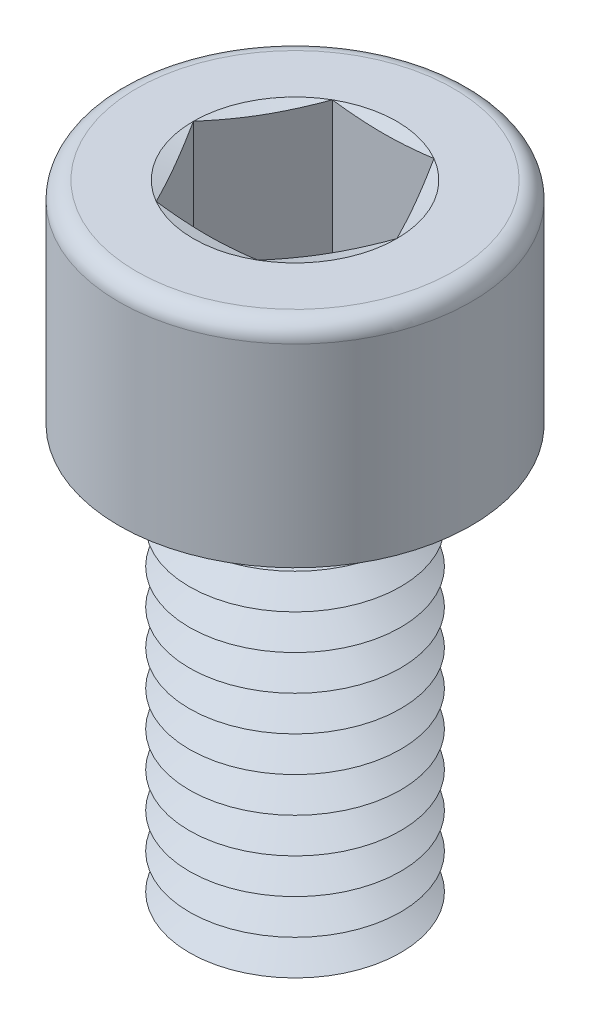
ISO-10303-21;
HEADER;
FILE_DESCRIPTION(('STEP AP214'),'2;1');
FILE_NAME('part.step','',(''),(''),'','','');
FILE_SCHEMA(('AUTOMOTIVE_DESIGN { 1 0 10303 214 1 1 1 1 }'));
ENDSEC;
DATA;
#1=APPLICATION_CONTEXT('core data for automotive mechanical design processes');
#2=APPLICATION_PROTOCOL_DEFINITION('international standard','automotive_design',2000,#1);
#3=PRODUCT_CONTEXT('',#1,'mechanical');
#4=PRODUCT('Part','Part','',(#3));
#5=PRODUCT_RELATED_PRODUCT_CATEGORY('part','',(#4));
#6=PRODUCT_DEFINITION_FORMATION('','',#4);
#7=PRODUCT_DEFINITION_CONTEXT('part definition',#1,'design');
#8=PRODUCT_DEFINITION('design','',#6,#7);
#9=PRODUCT_DEFINITION_SHAPE('','',#8);
#10=(LENGTH_UNIT() NAMED_UNIT(*) SI_UNIT(.MILLI.,.METRE.));
#11=(NAMED_UNIT(*) PLANE_ANGLE_UNIT() SI_UNIT($,.RADIAN.));
#12=(NAMED_UNIT(*) SI_UNIT($,.STERADIAN.) SOLID_ANGLE_UNIT());
#13=UNCERTAINTY_MEASURE_WITH_UNIT(LENGTH_MEASURE(1.E-05),#10,'distance_accuracy_value','');
#14=(GEOMETRIC_REPRESENTATION_CONTEXT(3) GLOBAL_UNCERTAINTY_ASSIGNED_CONTEXT((#13)) GLOBAL_UNIT_ASSIGNED_CONTEXT((#10,
#11,#12)) REPRESENTATION_CONTEXT('',''));
#15=CARTESIAN_POINT('',(0.,0.,0.));
#16=DIRECTION('',(0.,0.,1.));
#17=DIRECTION('',(1.,0.,0.));
#18=AXIS2_PLACEMENT_3D('',#15,#16,#17);
#19=CARTESIAN_POINT('',(0.,4.,0.));
#20=DIRECTION('',(0.,1.,0.));
#21=DIRECTION('',(0.,0.,1.));
#22=AXIS2_PLACEMENT_3D('',#19,#20,#21);
#23=CONICAL_SURFACE('',#22,2.13397459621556,1.0471975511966);
#24=CARTESIAN_POINT('',(0.,4.5,0.));
#25=DIRECTION('',(0.,1.,0.));
#26=DIRECTION('',(0.,0.,1.));
#27=AXIS2_PLACEMENT_3D('',#24,#25,#26);
#28=CIRCLE('',#27,3.);
#29=CARTESIAN_POINT('',(0.,4.5,3.));
#30=VERTEX_POINT('',#29);
#31=EDGE_CURVE('E407',#30,#30,#28,.T.);
#32=ORIENTED_EDGE('',*,*,#31,.F.);
#33=EDGE_LOOP('',(#32));
#34=FACE_BOUND('',#33,.T.);
#35=CARTESIAN_POINT('',(0.,4.,0.));
#36=DIRECTION('',(0.,1.,0.));
#37=DIRECTION('',(0.,0.,1.));
#38=AXIS2_PLACEMENT_3D('',#35,#36,#37);
#39=CIRCLE('',#38,2.13397459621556);
#40=CARTESIAN_POINT('',(0.,4.,2.13397459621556));
#41=VERTEX_POINT('',#40);
#42=EDGE_CURVE('E411',#41,#41,#39,.T.);
#43=ORIENTED_EDGE('',*,*,#42,.T.);
#44=EDGE_LOOP('',(#43));
#45=FACE_BOUND('',#44,.T.);
#46=ADVANCED_FACE('F41',(#34,#45),#23,.T.);
#47=CARTESIAN_POINT('',(0.,3.5,0.));
#48=DIRECTION('',(0.,-1.,0.));
#49=DIRECTION('',(0.,0.,-1.));
#50=AXIS2_PLACEMENT_3D('',#47,#48,#49);
#51=CONICAL_SURFACE('',#50,3.,1.0471975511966);
#52=ORIENTED_EDGE('',*,*,#42,.F.);
#53=EDGE_LOOP('',(#52));
#54=FACE_BOUND('',#53,.T.);
#55=CARTESIAN_POINT('',(0.,3.5,0.));
#56=DIRECTION('',(0.,1.,0.));
#57=DIRECTION('',(0.,0.,1.));
#58=AXIS2_PLACEMENT_3D('',#55,#56,#57);
#59=CIRCLE('',#58,3.);
#60=CARTESIAN_POINT('',(0.,3.5,3.));
#61=VERTEX_POINT('',#60);
#62=EDGE_CURVE('E415',#61,#61,#59,.T.);
#63=ORIENTED_EDGE('',*,*,#62,.T.);
#64=EDGE_LOOP('',(#63));
#65=FACE_BOUND('',#64,.T.);
#66=ADVANCED_FACE('F251',(#54,#65),#51,.T.);
#67=CARTESIAN_POINT('',(0.,0.,0.));
#68=DIRECTION('',(0.,1.,0.));
#69=DIRECTION('',(0.,0.,1.));
#70=AXIS2_PLACEMENT_3D('',#67,#68,#69);
#71=PLANE('',#70);
#72=CARTESIAN_POINT('',(0.,0.,0.));
#73=DIRECTION('',(0.,1.,0.));
#74=DIRECTION('',(0.,0.,1.));
#75=AXIS2_PLACEMENT_3D('',#72,#73,#74);
#76=CIRCLE('',#75,2.13397459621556);
#77=CARTESIAN_POINT('',(0.,0.,2.13397459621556));
#78=VERTEX_POINT('',#77);
#79=EDGE_CURVE('E442',#78,#78,#76,.T.);
#80=ORIENTED_EDGE('',*,*,#79,.F.);
#81=EDGE_LOOP('',(#80));
#82=FACE_BOUND('',#81,.T.);
#83=ADVANCED_FACE('F248',(#82),#71,.F.);
#84=CARTESIAN_POINT('',(0.,0.,0.));
#85=DIRECTION('',(0.,1.,0.));
#86=DIRECTION('',(0.,0.,1.));
#87=AXIS2_PLACEMENT_3D('',#84,#85,#86);
#88=CONICAL_SURFACE('',#87,2.13397459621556,1.0471975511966);
#89=CARTESIAN_POINT('',(0.,0.5,0.));
#90=DIRECTION('',(0.,1.,0.));
#91=DIRECTION('',(0.,0.,1.));
#92=AXIS2_PLACEMENT_3D('',#89,#90,#91);
#93=CIRCLE('',#92,3.);
#94=CARTESIAN_POINT('',(0.,0.5,3.));
#95=VERTEX_POINT('',#94);
#96=EDGE_CURVE('E438',#95,#95,#93,.T.);
#97=ORIENTED_EDGE('',*,*,#96,.F.);
#98=EDGE_LOOP('',(#97));
#99=FACE_BOUND('',#98,.T.);
#100=ORIENTED_EDGE('',*,*,#79,.T.);
#101=EDGE_LOOP('',(#100));
#102=FACE_BOUND('',#101,.T.);
#103=ADVANCED_FACE('F250',(#99,#102),#88,.T.);
#104=CARTESIAN_POINT('',(0.,0.5,0.));
#105=DIRECTION('',(0.,-1.,0.));
#106=DIRECTION('',(0.,0.,-1.));
#107=AXIS2_PLACEMENT_3D('',#104,#105,#106);
#108=CONICAL_SURFACE('',#107,3.,1.0471975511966);
#109=CARTESIAN_POINT('',(0.,1.,0.));
#110=DIRECTION('',(0.,1.,0.));
#111=DIRECTION('',(0.,0.,1.));
#112=AXIS2_PLACEMENT_3D('',#109,#110,#111);
#113=CIRCLE('',#112,2.13397459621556);
#114=CARTESIAN_POINT('',(0.,1.,2.13397459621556));
#115=VERTEX_POINT('',#114);
#116=EDGE_CURVE('E435',#115,#115,#113,.T.);
#117=ORIENTED_EDGE('',*,*,#116,.F.);
#118=EDGE_LOOP('',(#117));
#119=FACE_BOUND('',#118,.T.);
#120=ORIENTED_EDGE('',*,*,#96,.T.);
#121=EDGE_LOOP('',(#120));
#122=FACE_BOUND('',#121,.T.);
#123=ADVANCED_FACE('F291',(#119,#122),#108,.T.);
#124=CARTESIAN_POINT('',(0.,1.,0.));
#125=DIRECTION('',(0.,1.,0.));
#126=DIRECTION('',(0.,0.,1.));
#127=AXIS2_PLACEMENT_3D('',#124,#125,#126);
#128=CONICAL_SURFACE('',#127,2.13397459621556,1.0471975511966);
#129=CARTESIAN_POINT('',(0.,1.5,0.));
#130=DIRECTION('',(0.,1.,0.));
#131=DIRECTION('',(0.,0.,1.));
#132=AXIS2_PLACEMENT_3D('',#129,#130,#131);
#133=CIRCLE('',#132,3.);
#134=CARTESIAN_POINT('',(0.,1.5,3.));
#135=VERTEX_POINT('',#134);
#136=EDGE_CURVE('E431',#135,#135,#133,.T.);
#137=ORIENTED_EDGE('',*,*,#136,.F.);
#138=EDGE_LOOP('',(#137));
#139=FACE_BOUND('',#138,.T.);
#140=ORIENTED_EDGE('',*,*,#116,.T.);
#141=EDGE_LOOP('',(#140));
#142=FACE_BOUND('',#141,.T.);
#143=ADVANCED_FACE('F286',(#139,#142),#128,.T.);
#144=CARTESIAN_POINT('',(0.,1.5,0.));
#145=DIRECTION('',(0.,-1.,0.));
#146=DIRECTION('',(0.,0.,-1.));
#147=AXIS2_PLACEMENT_3D('',#144,#145,#146);
#148=CONICAL_SURFACE('',#147,3.,1.0471975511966);
#149=CARTESIAN_POINT('',(0.,2.,0.));
#150=DIRECTION('',(0.,1.,0.));
#151=DIRECTION('',(0.,0.,1.));
#152=AXIS2_PLACEMENT_3D('',#149,#150,#151);
#153=CIRCLE('',#152,2.13397459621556);
#154=CARTESIAN_POINT('',(0.,2.,2.13397459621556));
#155=VERTEX_POINT('',#154);
#156=EDGE_CURVE('E427',#155,#155,#153,.T.);
#157=ORIENTED_EDGE('',*,*,#156,.F.);
#158=EDGE_LOOP('',(#157));
#159=FACE_BOUND('',#158,.T.);
#160=ORIENTED_EDGE('',*,*,#136,.T.);
#161=EDGE_LOOP('',(#160));
#162=FACE_BOUND('',#161,.T.);
#163=ADVANCED_FACE('F283',(#159,#162),#148,.T.);
#164=CARTESIAN_POINT('',(0.,2.,0.));
#165=DIRECTION('',(0.,1.,0.));
#166=DIRECTION('',(0.,0.,1.));
#167=AXIS2_PLACEMENT_3D('',#164,#165,#166);
#168=CONICAL_SURFACE('',#167,2.13397459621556,1.0471975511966);
#169=CARTESIAN_POINT('',(0.,2.5,0.));
#170=DIRECTION('',(0.,1.,0.));
#171=DIRECTION('',(0.,0.,1.));
#172=AXIS2_PLACEMENT_3D('',#169,#170,#171);
#173=CIRCLE('',#172,3.);
#174=CARTESIAN_POINT('',(0.,2.5,3.));
#175=VERTEX_POINT('',#174);
#176=EDGE_CURVE('E423',#175,#175,#173,.T.);
#177=ORIENTED_EDGE('',*,*,#176,.F.);
#178=EDGE_LOOP('',(#177));
#179=FACE_BOUND('',#178,.T.);
#180=ORIENTED_EDGE('',*,*,#156,.T.);
#181=EDGE_LOOP('',(#180));
#182=FACE_BOUND('',#181,.T.);
#183=ADVANCED_FACE('F277',(#179,#182),#168,.T.);
#184=CARTESIAN_POINT('',(0.,2.5,0.));
#185=DIRECTION('',(0.,-1.,0.));
#186=DIRECTION('',(0.,0.,-1.));
#187=AXIS2_PLACEMENT_3D('',#184,#185,#186);
#188=CONICAL_SURFACE('',#187,3.,1.0471975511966);
#189=CARTESIAN_POINT('',(0.,3.,0.));
#190=DIRECTION('',(0.,1.,0.));
#191=DIRECTION('',(0.,0.,1.));
#192=AXIS2_PLACEMENT_3D('',#189,#190,#191);
#193=CIRCLE('',#192,2.13397459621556);
#194=CARTESIAN_POINT('',(0.,3.,2.13397459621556));
#195=VERTEX_POINT('',#194);
#196=EDGE_CURVE('E419',#195,#195,#193,.T.);
#197=ORIENTED_EDGE('',*,*,#196,.F.);
#198=EDGE_LOOP('',(#197));
#199=FACE_BOUND('',#198,.T.);
#200=ORIENTED_EDGE('',*,*,#176,.T.);
#201=EDGE_LOOP('',(#200));
#202=FACE_BOUND('',#201,.T.);
#203=ADVANCED_FACE('F273',(#199,#202),#188,.T.);
#204=CARTESIAN_POINT('',(0.,3.,0.));
#205=DIRECTION('',(0.,1.,0.));
#206=DIRECTION('',(0.,0.,1.));
#207=AXIS2_PLACEMENT_3D('',#204,#205,#206);
#208=CONICAL_SURFACE('',#207,2.13397459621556,1.0471975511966);
#209=ORIENTED_EDGE('',*,*,#62,.F.);
#210=EDGE_LOOP('',(#209));
#211=FACE_BOUND('',#210,.T.);
#212=ORIENTED_EDGE('',*,*,#196,.T.);
#213=EDGE_LOOP('',(#212));
#214=FACE_BOUND('',#213,.T.);
#215=ADVANCED_FACE('F276',(#211,#214),#208,.T.);
#216=CARTESIAN_POINT('',(0.,5.,0.));
#217=DIRECTION('',(0.,1.,0.));
#218=DIRECTION('',(0.,0.,1.));
#219=AXIS2_PLACEMENT_3D('',#216,#217,#218);
#220=CONICAL_SURFACE('',#219,2.13397459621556,1.0471975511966);
#221=CARTESIAN_POINT('',(0.,5.5,0.));
#222=DIRECTION('',(0.,1.,0.));
#223=DIRECTION('',(0.,0.,1.));
#224=AXIS2_PLACEMENT_3D('',#221,#222,#223);
#225=CIRCLE('',#224,3.);
#226=CARTESIAN_POINT('',(0.,5.5,3.));
#227=VERTEX_POINT('',#226);
#228=EDGE_CURVE('E399',#227,#227,#225,.T.);
#229=ORIENTED_EDGE('',*,*,#228,.F.);
#230=EDGE_LOOP('',(#229));
#231=FACE_BOUND('',#230,.T.);
#232=CARTESIAN_POINT('',(0.,5.,0.));
#233=DIRECTION('',(0.,1.,0.));
#234=DIRECTION('',(0.,0.,1.));
#235=AXIS2_PLACEMENT_3D('',#232,#233,#234);
#236=CIRCLE('',#235,2.13397459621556);
#237=CARTESIAN_POINT('',(0.,5.,2.13397459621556));
#238=VERTEX_POINT('',#237);
#239=EDGE_CURVE('E403',#238,#238,#236,.T.);
#240=ORIENTED_EDGE('',*,*,#239,.T.);
#241=EDGE_LOOP('',(#240));
#242=FACE_BOUND('',#241,.T.);
#243=ADVANCED_FACE('F281',(#231,#242),#220,.T.);
#244=CARTESIAN_POINT('',(0.,4.5,0.));
#245=DIRECTION('',(0.,-1.,0.));
#246=DIRECTION('',(0.,0.,-1.));
#247=AXIS2_PLACEMENT_3D('',#244,#245,#246);
#248=CONICAL_SURFACE('',#247,3.,1.0471975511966);
#249=ORIENTED_EDGE('',*,*,#239,.F.);
#250=EDGE_LOOP('',(#249));
#251=FACE_BOUND('',#250,.T.);
#252=ORIENTED_EDGE('',*,*,#31,.T.);
#253=EDGE_LOOP('',(#252));
#254=FACE_BOUND('',#253,.T.);
#255=ADVANCED_FACE('F673',(#251,#254),#248,.T.);
#256=CARTESIAN_POINT('',(0.,6.,0.));
#257=DIRECTION('',(0.,1.,0.));
#258=DIRECTION('',(0.,0.,1.));
#259=AXIS2_PLACEMENT_3D('',#256,#257,#258);
#260=CONICAL_SURFACE('',#259,2.13397459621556,1.0471975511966);
#261=CARTESIAN_POINT('',(0.,6.5,0.));
#262=DIRECTION('',(0.,1.,0.));
#263=DIRECTION('',(0.,0.,1.));
#264=AXIS2_PLACEMENT_3D('',#261,#262,#263);
#265=CIRCLE('',#264,3.);
#266=CARTESIAN_POINT('',(0.,6.5,3.));
#267=VERTEX_POINT('',#266);
#268=EDGE_CURVE('E391',#267,#267,#265,.T.);
#269=ORIENTED_EDGE('',*,*,#268,.F.);
#270=EDGE_LOOP('',(#269));
#271=FACE_BOUND('',#270,.T.);
#272=CARTESIAN_POINT('',(0.,6.,0.));
#273=DIRECTION('',(0.,1.,0.));
#274=DIRECTION('',(0.,0.,1.));
#275=AXIS2_PLACEMENT_3D('',#272,#273,#274);
#276=CIRCLE('',#275,2.13397459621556);
#277=CARTESIAN_POINT('',(0.,6.,2.13397459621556));
#278=VERTEX_POINT('',#277);
#279=EDGE_CURVE('E395',#278,#278,#276,.T.);
#280=ORIENTED_EDGE('',*,*,#279,.T.);
#281=EDGE_LOOP('',(#280));
#282=FACE_BOUND('',#281,.T.);
#283=ADVANCED_FACE('F682',(#271,#282),#260,.T.);
#284=CARTESIAN_POINT('',(0.,5.5,0.));
#285=DIRECTION('',(0.,-1.,0.));
#286=DIRECTION('',(0.,0.,-1.));
#287=AXIS2_PLACEMENT_3D('',#284,#285,#286);
#288=CONICAL_SURFACE('',#287,3.,1.0471975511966);
#289=ORIENTED_EDGE('',*,*,#279,.F.);
#290=EDGE_LOOP('',(#289));
#291=FACE_BOUND('',#290,.T.);
#292=ORIENTED_EDGE('',*,*,#228,.T.);
#293=EDGE_LOOP('',(#292));
#294=FACE_BOUND('',#293,.T.);
#295=ADVANCED_FACE('F692',(#291,#294),#288,.T.);
#296=CARTESIAN_POINT('',(0.,7.,0.));
#297=DIRECTION('',(0.,1.,0.));
#298=DIRECTION('',(0.,0.,1.));
#299=AXIS2_PLACEMENT_3D('',#296,#297,#298);
#300=CONICAL_SURFACE('',#299,2.13397459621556,1.0471975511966);
#301=CARTESIAN_POINT('',(0.,7.5,0.));
#302=DIRECTION('',(0.,1.,0.));
#303=DIRECTION('',(0.,0.,1.));
#304=AXIS2_PLACEMENT_3D('',#301,#302,#303);
#305=CIRCLE('',#304,3.);
#306=CARTESIAN_POINT('',(0.,7.5,3.));
#307=VERTEX_POINT('',#306);
#308=EDGE_CURVE('E383',#307,#307,#305,.T.);
#309=ORIENTED_EDGE('',*,*,#308,.F.);
#310=EDGE_LOOP('',(#309));
#311=FACE_BOUND('',#310,.T.);
#312=CARTESIAN_POINT('',(0.,7.,0.));
#313=DIRECTION('',(0.,1.,0.));
#314=DIRECTION('',(0.,0.,1.));
#315=AXIS2_PLACEMENT_3D('',#312,#313,#314);
#316=CIRCLE('',#315,2.13397459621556);
#317=CARTESIAN_POINT('',(0.,7.,2.13397459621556));
#318=VERTEX_POINT('',#317);
#319=EDGE_CURVE('E387',#318,#318,#316,.T.);
#320=ORIENTED_EDGE('',*,*,#319,.T.);
#321=EDGE_LOOP('',(#320));
#322=FACE_BOUND('',#321,.T.);
#323=ADVANCED_FACE('F702',(#311,#322),#300,.T.);
#324=CARTESIAN_POINT('',(0.,6.5,0.));
#325=DIRECTION('',(0.,-1.,0.));
#326=DIRECTION('',(0.,0.,-1.));
#327=AXIS2_PLACEMENT_3D('',#324,#325,#326);
#328=CONICAL_SURFACE('',#327,3.,1.0471975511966);
#329=ORIENTED_EDGE('',*,*,#319,.F.);
#330=EDGE_LOOP('',(#329));
#331=FACE_BOUND('',#330,.T.);
#332=ORIENTED_EDGE('',*,*,#268,.T.);
#333=EDGE_LOOP('',(#332));
#334=FACE_BOUND('',#333,.T.);
#335=ADVANCED_FACE('F712',(#331,#334),#328,.T.);
#336=CARTESIAN_POINT('',(0.,8.,0.));
#337=DIRECTION('',(0.,1.,0.));
#338=DIRECTION('',(0.,0.,1.));
#339=AXIS2_PLACEMENT_3D('',#336,#337,#338);
#340=CONICAL_SURFACE('',#339,2.13397459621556,1.0471975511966);
#341=CARTESIAN_POINT('',(0.,8.5,0.));
#342=DIRECTION('',(0.,1.,0.));
#343=DIRECTION('',(0.,0.,1.));
#344=AXIS2_PLACEMENT_3D('',#341,#342,#343);
#345=CIRCLE('',#344,3.);
#346=CARTESIAN_POINT('',(0.,8.5,3.));
#347=VERTEX_POINT('',#346);
#348=EDGE_CURVE('E376',#347,#347,#345,.T.);
#349=ORIENTED_EDGE('',*,*,#348,.F.);
#350=EDGE_LOOP('',(#349));
#351=FACE_BOUND('',#350,.T.);
#352=CARTESIAN_POINT('',(0.,8.,0.));
#353=DIRECTION('',(0.,1.,0.));
#354=DIRECTION('',(0.,0.,1.));
#355=AXIS2_PLACEMENT_3D('',#352,#353,#354);
#356=CIRCLE('',#355,2.13397459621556);
#357=CARTESIAN_POINT('',(0.,8.,2.13397459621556));
#358=VERTEX_POINT('',#357);
#359=EDGE_CURVE('E380',#358,#358,#356,.T.);
#360=ORIENTED_EDGE('',*,*,#359,.T.);
#361=EDGE_LOOP('',(#360));
#362=FACE_BOUND('',#361,.T.);
#363=ADVANCED_FACE('F722',(#351,#362),#340,.T.);
#364=CARTESIAN_POINT('',(0.,7.5,0.));
#365=DIRECTION('',(0.,-1.,0.));
#366=DIRECTION('',(0.,0.,-1.));
#367=AXIS2_PLACEMENT_3D('',#364,#365,#366);
#368=CONICAL_SURFACE('',#367,3.,1.0471975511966);
#369=ORIENTED_EDGE('',*,*,#359,.F.);
#370=EDGE_LOOP('',(#369));
#371=FACE_BOUND('',#370,.T.);
#372=ORIENTED_EDGE('',*,*,#308,.T.);
#373=EDGE_LOOP('',(#372));
#374=FACE_BOUND('',#373,.T.);
#375=ADVANCED_FACE('F732',(#371,#374),#368,.T.);
#376=CARTESIAN_POINT('',(0.,9.,0.));
#377=DIRECTION('',(0.,1.,0.));
#378=DIRECTION('',(0.,0.,1.));
#379=AXIS2_PLACEMENT_3D('',#376,#377,#378);
#380=CONICAL_SURFACE('',#379,2.13397459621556,1.0471975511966);
#381=CARTESIAN_POINT('',(0.,9.5,0.));
#382=DIRECTION('',(0.,1.,0.));
#383=DIRECTION('',(0.,0.,1.));
#384=AXIS2_PLACEMENT_3D('',#381,#382,#383);
#385=CIRCLE('',#384,3.);
#386=CARTESIAN_POINT('',(0.,9.5,3.));
#387=VERTEX_POINT('',#386);
#388=EDGE_CURVE('E369',#387,#387,#385,.T.);
#389=ORIENTED_EDGE('',*,*,#388,.F.);
#390=EDGE_LOOP('',(#389));
#391=FACE_BOUND('',#390,.T.);
#392=CARTESIAN_POINT('',(0.,9.,0.));
#393=DIRECTION('',(0.,1.,0.));
#394=DIRECTION('',(0.,0.,1.));
#395=AXIS2_PLACEMENT_3D('',#392,#393,#394);
#396=CIRCLE('',#395,2.13397459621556);
#397=CARTESIAN_POINT('',(0.,9.,2.13397459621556));
#398=VERTEX_POINT('',#397);
#399=EDGE_CURVE('E372',#398,#398,#396,.T.);
#400=ORIENTED_EDGE('',*,*,#399,.T.);
#401=EDGE_LOOP('',(#400));
#402=FACE_BOUND('',#401,.T.);
#403=ADVANCED_FACE('F742',(#391,#402),#380,.T.);
#404=CARTESIAN_POINT('',(0.,8.5,0.));
#405=DIRECTION('',(0.,-1.,0.));
#406=DIRECTION('',(0.,0.,-1.));
#407=AXIS2_PLACEMENT_3D('',#404,#405,#406);
#408=CONICAL_SURFACE('',#407,3.,1.0471975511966);
#409=ORIENTED_EDGE('',*,*,#399,.F.);
#410=EDGE_LOOP('',(#409));
#411=FACE_BOUND('',#410,.T.);
#412=ORIENTED_EDGE('',*,*,#348,.T.);
#413=EDGE_LOOP('',(#412));
#414=FACE_BOUND('',#413,.T.);
#415=ADVANCED_FACE('F752',(#411,#414),#408,.T.);
#416=CARTESIAN_POINT('',(0.,10.,0.));
#417=DIRECTION('',(0.,1.,0.));
#418=DIRECTION('',(0.,0.,1.));
#419=AXIS2_PLACEMENT_3D('',#416,#417,#418);
#420=CONICAL_SURFACE('',#419,2.13397459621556,1.0471975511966);
#421=CARTESIAN_POINT('',(0.,10.5,0.));
#422=DIRECTION('',(0.,1.,0.));
#423=DIRECTION('',(0.,0.,1.));
#424=AXIS2_PLACEMENT_3D('',#421,#422,#423);
#425=CIRCLE('',#424,3.);
#426=CARTESIAN_POINT('',(0.,10.5,3.));
#427=VERTEX_POINT('',#426);
#428=EDGE_CURVE('E353',#427,#427,#425,.T.);
#429=ORIENTED_EDGE('',*,*,#428,.F.);
#430=EDGE_LOOP('',(#429));
#431=FACE_BOUND('',#430,.T.);
#432=CARTESIAN_POINT('',(0.,10.,0.));
#433=DIRECTION('',(0.,1.,0.));
#434=DIRECTION('',(0.,0.,1.));
#435=AXIS2_PLACEMENT_3D('',#432,#433,#434);
#436=CIRCLE('',#435,2.13397459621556);
#437=CARTESIAN_POINT('',(0.,10.,2.13397459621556));
#438=VERTEX_POINT('',#437);
#439=EDGE_CURVE('E365',#438,#438,#436,.T.);
#440=ORIENTED_EDGE('',*,*,#439,.T.);
#441=EDGE_LOOP('',(#440));
#442=FACE_BOUND('',#441,.T.);
#443=ADVANCED_FACE('F762',(#431,#442),#420,.T.);
#444=CARTESIAN_POINT('',(0.,9.5,0.));
#445=DIRECTION('',(0.,-1.,0.));
#446=DIRECTION('',(0.,0.,-1.));
#447=AXIS2_PLACEMENT_3D('',#444,#445,#446);
#448=CONICAL_SURFACE('',#447,3.,1.0471975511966);
#449=ORIENTED_EDGE('',*,*,#439,.F.);
#450=EDGE_LOOP('',(#449));
#451=FACE_BOUND('',#450,.T.);
#452=ORIENTED_EDGE('',*,*,#388,.T.);
#453=EDGE_LOOP('',(#452));
#454=FACE_BOUND('',#453,.T.);
#455=ADVANCED_FACE('F772',(#451,#454),#448,.T.);
#456=CARTESIAN_POINT('',(0.,11.,0.));
#457=DIRECTION('',(0.,1.,0.));
#458=DIRECTION('',(0.,0.,1.));
#459=AXIS2_PLACEMENT_3D('',#456,#457,#458);
#460=CONICAL_SURFACE('',#459,2.13397459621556,1.0471975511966);
#461=CARTESIAN_POINT('',(0.,11.5,0.));
#462=DIRECTION('',(0.,1.,0.));
#463=DIRECTION('',(0.,0.,1.));
#464=AXIS2_PLACEMENT_3D('',#461,#462,#463);
#465=CIRCLE('',#464,3.);
#466=CARTESIAN_POINT('',(0.,11.5,3.));
#467=VERTEX_POINT('',#466);
#468=EDGE_CURVE('E360',#467,#467,#465,.T.);
#469=ORIENTED_EDGE('',*,*,#468,.F.);
#470=EDGE_LOOP('',(#469));
#471=FACE_BOUND('',#470,.T.);
#472=CARTESIAN_POINT('',(0.,11.,0.));
#473=DIRECTION('',(0.,1.,0.));
#474=DIRECTION('',(0.,0.,1.));
#475=AXIS2_PLACEMENT_3D('',#472,#473,#474);
#476=CIRCLE('',#475,2.13397459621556);
#477=CARTESIAN_POINT('',(0.,11.,2.13397459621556));
#478=VERTEX_POINT('',#477);
#479=EDGE_CURVE('E348',#478,#478,#476,.T.);
#480=ORIENTED_EDGE('',*,*,#479,.T.);
#481=EDGE_LOOP('',(#480));
#482=FACE_BOUND('',#481,.T.);
#483=ADVANCED_FACE('F782',(#471,#482),#460,.T.);
#484=CARTESIAN_POINT('',(0.,10.5,0.));
#485=DIRECTION('',(0.,-1.,0.));
#486=DIRECTION('',(0.,0.,-1.));
#487=AXIS2_PLACEMENT_3D('',#484,#485,#486);
#488=CONICAL_SURFACE('',#487,3.,1.0471975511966);
#489=ORIENTED_EDGE('',*,*,#479,.F.);
#490=EDGE_LOOP('',(#489));
#491=FACE_BOUND('',#490,.T.);
#492=ORIENTED_EDGE('',*,*,#428,.T.);
#493=EDGE_LOOP('',(#492));
#494=FACE_BOUND('',#493,.T.);
#495=ADVANCED_FACE('F195',(#491,#494),#488,.T.);
#496=CARTESIAN_POINT('',(0.,18.,0.));
#497=DIRECTION('',(0.,1.,0.));
#498=DIRECTION('',(0.,0.,1.));
#499=AXIS2_PLACEMENT_3D('',#496,#497,#498);
#500=PLANE('',#499);
#501=CARTESIAN_POINT('',(0.,18.,0.));
#502=DIRECTION('',(0.,1.,0.));
#503=DIRECTION('',(0.,0.,1.));
#504=AXIS2_PLACEMENT_3D('',#501,#502,#503);
#505=CIRCLE('',#504,2.88675134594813);
#506=CARTESIAN_POINT('',(1.44337567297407,18.,2.5));
#507=VERTEX_POINT('',#506);
#508=CARTESIAN_POINT('',(2.88675134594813,18.,0.));
#509=VERTEX_POINT('',#508);
#510=EDGE_CURVE('E121',#507,#509,#505,.T.);
#511=ORIENTED_EDGE('',*,*,#510,.F.);
#512=CARTESIAN_POINT('',(0.,18.,0.));
#513=DIRECTION('',(0.,1.,0.));
#514=DIRECTION('',(0.,0.,1.));
#515=AXIS2_PLACEMENT_3D('',#512,#513,#514);
#516=CIRCLE('',#515,2.88675134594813);
#517=CARTESIAN_POINT('',(-1.44337567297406,18.,2.5));
#518=VERTEX_POINT('',#517);
#519=EDGE_CURVE('E45',#518,#507,#516,.T.);
#520=ORIENTED_EDGE('',*,*,#519,.F.);
#521=CARTESIAN_POINT('',(-2.88675134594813,18.,0.));
#522=VERTEX_POINT('',#521);
#523=EDGE_CURVE('E138',#522,#518,#516,.T.);
#524=ORIENTED_EDGE('',*,*,#523,.F.);
#525=CARTESIAN_POINT('',(-1.44337567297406,18.,-2.5));
#526=VERTEX_POINT('',#525);
#527=EDGE_CURVE('E914',#526,#522,#516,.T.);
#528=ORIENTED_EDGE('',*,*,#527,.F.);
#529=CARTESIAN_POINT('',(1.44337567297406,18.,-2.5));
#530=VERTEX_POINT('',#529);
#531=EDGE_CURVE('E51',#530,#526,#516,.T.);
#532=ORIENTED_EDGE('',*,*,#531,.F.);
#533=EDGE_CURVE('E11',#509,#530,#516,.T.);
#534=ORIENTED_EDGE('',*,*,#533,.F.);
#535=EDGE_LOOP('',(#511,#520,#524,#528,#532,#534));
#536=FACE_BOUND('',#535,.T.);
#537=CARTESIAN_POINT('',(0.,18.,0.));
#538=DIRECTION('',(0.,1.,0.));
#539=DIRECTION('',(0.,0.,1.));
#540=AXIS2_PLACEMENT_3D('',#537,#538,#539);
#541=CIRCLE('',#540,4.5);
#542=CARTESIAN_POINT('',(0.,18.,4.5));
#543=VERTEX_POINT('',#542);
#544=EDGE_CURVE('E486',#543,#543,#541,.T.);
#545=ORIENTED_EDGE('',*,*,#544,.T.);
#546=EDGE_LOOP('',(#545));
#547=FACE_BOUND('',#546,.T.);
#548=ADVANCED_FACE('F140',(#536,#547),#500,.T.);
#549=CARTESIAN_POINT('',(0.,17.5,0.));
#550=DIRECTION('',(0.,1.,0.));
#551=DIRECTION('',(0.,0.,1.));
#552=AXIS2_PLACEMENT_3D('',#549,#550,#551);
#553=TOROIDAL_SURFACE('',#552,4.5,0.5);
#554=CARTESIAN_POINT('',(0.,17.5,0.));
#555=DIRECTION('',(0.,1.,0.));
#556=DIRECTION('',(0.,0.,1.));
#557=AXIS2_PLACEMENT_3D('',#554,#555,#556);
#558=CIRCLE('',#557,5.);
#559=CARTESIAN_POINT('',(0.,17.5,5.));
#560=VERTEX_POINT('',#559);
#561=EDGE_CURVE('E490',#560,#560,#558,.F.);
#562=ORIENTED_EDGE('',*,*,#561,.F.);
#563=EDGE_LOOP('',(#562));
#564=FACE_BOUND('',#563,.T.);
#565=ORIENTED_EDGE('',*,*,#544,.F.);
#566=EDGE_LOOP('',(#565));
#567=FACE_BOUND('',#566,.T.);
#568=ADVANCED_FACE('F43',(#564,#567),#553,.T.);
#569=CARTESIAN_POINT('',(0.,18.,0.));
#570=DIRECTION('',(0.,-1.,0.));
#571=DIRECTION('',(0.,0.,-1.));
#572=AXIS2_PLACEMENT_3D('',#569,#570,#571);
#573=CYLINDRICAL_SURFACE('',#572,5.);
#574=ORIENTED_EDGE('',*,*,#561,.T.);
#575=EDGE_LOOP('',(#574));
#576=FACE_BOUND('',#575,.T.);
#577=CARTESIAN_POINT('',(0.,12.,0.));
#578=DIRECTION('',(0.,1.,0.));
#579=DIRECTION('',(0.,0.,1.));
#580=AXIS2_PLACEMENT_3D('',#577,#578,#579);
#581=CIRCLE('',#580,5.);
#582=CARTESIAN_POINT('',(0.,12.,5.));
#583=VERTEX_POINT('',#582);
#584=EDGE_CURVE('E474',#583,#583,#581,.T.);
#585=ORIENTED_EDGE('',*,*,#584,.T.);
#586=EDGE_LOOP('',(#585));
#587=FACE_BOUND('',#586,.T.);
#588=ADVANCED_FACE('F243',(#576,#587),#573,.T.);
#589=CARTESIAN_POINT('',(0.,12.,0.));
#590=DIRECTION('',(0.,1.,0.));
#591=DIRECTION('',(0.,0.,1.));
#592=AXIS2_PLACEMENT_3D('',#589,#590,#591);
#593=PLANE('',#592);
#594=ORIENTED_EDGE('',*,*,#584,.F.);
#595=EDGE_LOOP('',(#594));
#596=FACE_BOUND('',#595,.T.);
#597=CARTESIAN_POINT('',(0.,12.,0.));
#598=DIRECTION('',(0.,1.,0.));
#599=DIRECTION('',(0.,0.,1.));
#600=AXIS2_PLACEMENT_3D('',#597,#598,#599);
#601=CIRCLE('',#600,3.);
#602=CARTESIAN_POINT('',(0.,12.,3.));
#603=VERTEX_POINT('',#602);
#604=EDGE_CURVE('E482',#603,#603,#601,.T.);
#605=ORIENTED_EDGE('',*,*,#604,.T.);
#606=EDGE_LOOP('',(#605));
#607=FACE_BOUND('',#606,.T.);
#608=ADVANCED_FACE('F239',(#596,#607),#593,.F.);
#609=CARTESIAN_POINT('',(0.,12.,0.));
#610=DIRECTION('',(0.,-1.,0.));
#611=DIRECTION('',(0.,0.,-1.));
#612=AXIS2_PLACEMENT_3D('',#609,#610,#611);
#613=CYLINDRICAL_SURFACE('',#612,3.);
#614=ORIENTED_EDGE('',*,*,#468,.T.);
#615=EDGE_LOOP('',(#614));
#616=FACE_BOUND('',#615,.T.);
#617=ORIENTED_EDGE('',*,*,#604,.F.);
#618=EDGE_LOOP('',(#617));
#619=FACE_BOUND('',#618,.T.);
#620=ADVANCED_FACE('F242',(#616,#619),#613,.T.);
#621=CARTESIAN_POINT('',(0.,18.,0.));
#622=DIRECTION('',(0.,1.,0.));
#623=DIRECTION('',(0.,0.,1.));
#624=AXIS2_PLACEMENT_3D('',#621,#622,#623);
#625=CONICAL_SURFACE('',#624,2.88675134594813,1.30899693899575);
#626=ORIENTED_EDGE('',*,*,#519,.T.);
#627=CARTESIAN_POINT('',(-3.76800948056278,18.4381461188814,2.5));
#628=CARTESIAN_POINT('',(-3.65512241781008,18.4129478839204,2.5));
#629=CARTESIAN_POINT('',(-3.54216337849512,18.3880668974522,2.5));
#630=CARTESIAN_POINT('',(-3.31606595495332,18.3391094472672,2.5));
#631=CARTESIAN_POINT('',(-3.202927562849,18.3150330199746,2.5));
#632=CARTESIAN_POINT('',(-2.97632910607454,18.2678326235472,2.5));
#633=CARTESIAN_POINT('',(-2.86286882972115,18.244709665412,2.5));
#634=CARTESIAN_POINT('',(-2.63570880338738,18.1996785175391,2.5));
#635=CARTESIAN_POINT('',(-2.522009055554,18.177770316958,2.5));
#636=CARTESIAN_POINT('',(-2.18246936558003,18.1146408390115,2.5));
#637=CARTESIAN_POINT('',(-1.95621666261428,18.0755946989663,2.5));
#638=CARTESIAN_POINT('',(-1.50233128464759,18.0064242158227,2.5));
#639=CARTESIAN_POINT('',(-1.27469889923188,17.9762980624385,2.5));
#640=CARTESIAN_POINT('',(-0.930935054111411,17.9407375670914,2.5));
#641=CARTESIAN_POINT('',(-0.815306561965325,17.9304588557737,2.5));
#642=CARTESIAN_POINT('',(-0.583775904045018,17.9137426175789,2.5));
#643=CARTESIAN_POINT('',(-0.467873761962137,17.9073047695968,2.5));
#644=CARTESIAN_POINT('',(-0.23595562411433,17.8986442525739,2.5));
#645=CARTESIAN_POINT('',(-0.119939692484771,17.8964198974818,2.5));
#646=CARTESIAN_POINT('',(0.112094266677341,17.8963223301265,2.5));
#647=CARTESIAN_POINT('',(0.228112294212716,17.8984491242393,2.5));
#648=CARTESIAN_POINT('',(0.460464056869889,17.9069362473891,2.5));
#649=CARTESIAN_POINT('',(0.576797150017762,17.9133138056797,2.5));
#650=CARTESIAN_POINT('',(0.809186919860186,17.9299460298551,2.5));
#651=CARTESIAN_POINT('',(0.925243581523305,17.9402009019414,2.5));
#652=CARTESIAN_POINT('',(1.1570783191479,17.9640809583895,2.5));
#653=CARTESIAN_POINT('',(1.27285617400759,17.9777082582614,2.5));
#654=CARTESIAN_POINT('',(1.5040397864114,18.0077859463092,2.5));
#655=CARTESIAN_POINT('',(1.61944554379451,18.0242363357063,2.5));
#656=CARTESIAN_POINT('',(1.97116037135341,18.0779484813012,2.5));
#657=CARTESIAN_POINT('',(2.20690405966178,18.1188940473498,2.5));
#658=CARTESIAN_POINT('',(2.67723558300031,18.2069642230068,2.5));
#659=CARTESIAN_POINT('',(2.9118232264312,18.2540898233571,2.5));
#660=CARTESIAN_POINT('',(3.38022088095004,18.3523532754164,2.5));
#661=CARTESIAN_POINT('',(3.61403064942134,18.4034922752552,2.5));
#662=CARTESIAN_POINT('',(4.08105387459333,18.5084282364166,2.5));
#663=CARTESIAN_POINT('',(4.31426731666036,18.5622252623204,2.5));
#664=CARTESIAN_POINT('',(4.77742011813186,18.6709766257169,2.5));
#665=CARTESIAN_POINT('',(5.00736469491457,18.7259088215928,2.5));
#666=CARTESIAN_POINT('',(5.46695141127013,18.8370433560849,2.5));
#667=CARTESIAN_POINT('',(5.69659354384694,18.8932457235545,2.5));
#668=CARTESIAN_POINT('',(6.15532898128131,19.006497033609,2.5));
#669=CARTESIAN_POINT('',(6.38442260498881,19.0635446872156,2.5));
#670=CARTESIAN_POINT('',(6.84242442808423,19.1783451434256,2.5));
#671=CARTESIAN_POINT('',(7.07133263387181,19.2360979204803,2.5));
#672=CARTESIAN_POINT('',(7.30017784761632,19.2940964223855,2.5));
#673=B_SPLINE_CURVE_WITH_KNOTS('',3,(#627,#628,#629,#630,#631,#632,#633,#634,#635,#636,#637,
#638,#639,#640,#641,#642,#643,#644,#645,#646,#647,#648,#649,#650,#651,#652,#653,#654,#655,#656,
#657,#658,#659,#660,#661,#662,#663,#664,#665,#666,#667,#668,#669,#670,#671,#672),.UNSPECIFIED.,
.F.,.F.,(4,2,2,2,2,2,2,2,2,2,2,2,2,2,2,2,2,2,2,2,2,2,4),(0.,0.346996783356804,0.694009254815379,
1.04138068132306,1.38874900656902,2.07743762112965,2.76598637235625,3.11418615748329,
3.46235682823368,3.81038814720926,4.15841997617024,4.50787110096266,4.85734081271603,
5.2070303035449,5.55671994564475,6.27438533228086,6.99216591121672,7.71015258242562,
8.42815670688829,9.13739674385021,9.84665290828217,10.5549206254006,11.2631627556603),.UNSPECIFIED.);
#674=EDGE_CURVE('E127',#518,#507,#673,.T.);
#675=ORIENTED_EDGE('',*,*,#674,.F.);
#676=EDGE_LOOP('',(#626,#675));
#677=FACE_BOUND('',#676,.T.);
#678=ADVANCED_FACE('F132',(#677),#625,.F.);
#679=ORIENTED_EDGE('',*,*,#523,.T.);
#680=CARTESIAN_POINT('',(-2.88686681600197,18.000030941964,-0.00020000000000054));
#681=CARTESIAN_POINT('',(-2.82691749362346,17.9839595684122,0.103635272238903));
#682=CARTESIAN_POINT('',(-2.7668594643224,17.9693693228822,0.207658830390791));
#683=CARTESIAN_POINT('',(-2.64653127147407,17.9437355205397,0.416073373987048));
#684=CARTESIAN_POINT('',(-2.58626103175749,17.9326934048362,0.520464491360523));
#685=CARTESIAN_POINT('',(-2.4658738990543,17.9148005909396,0.728981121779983));
#686=CARTESIAN_POINT('',(-2.40575782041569,17.9079285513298,0.833105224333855));
#687=CARTESIAN_POINT('',(-2.28544898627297,17.8987138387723,1.04148623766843));
#688=CARTESIAN_POINT('',(-2.22525624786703,17.8963702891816,1.14574311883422));
#689=CARTESIAN_POINT('',(-2.10487077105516,17.8963702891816,1.35425688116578));
#690=CARTESIAN_POINT('',(-2.04467803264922,17.8987138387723,1.45851376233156));
#691=CARTESIAN_POINT('',(-1.9243691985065,17.9079285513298,1.66689477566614));
#692=CARTESIAN_POINT('',(-1.86425311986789,17.9148005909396,1.77101887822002));
#693=CARTESIAN_POINT('',(-1.7438659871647,17.9326934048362,1.97953550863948));
#694=CARTESIAN_POINT('',(-1.68359574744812,17.9437355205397,2.08392662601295));
#695=CARTESIAN_POINT('',(-1.56326755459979,17.9693693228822,2.29234116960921));
#696=CARTESIAN_POINT('',(-1.50320952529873,17.9839595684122,2.3963647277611));
#697=CARTESIAN_POINT('',(-1.44326020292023,18.000030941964,2.5002));
#698=B_SPLINE_CURVE_WITH_KNOTS('',3,(#680,#681,#682,#683,#684,#685,#686,#687,#688,#689,#690,
#691,#692,#693,#694,#695,#696,#697),.UNSPECIFIED.,.F.,.F.,(4,2,2,2,2,2,2,2,4),(0.,
0.362931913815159,0.726011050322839,1.08721601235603,1.44835104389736,1.80948607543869,
2.17069103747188,2.53377017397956,2.89670208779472),.UNSPECIFIED.);
#699=EDGE_CURVE('E163',#522,#518,#698,.T.);
#700=ORIENTED_EDGE('',*,*,#699,.F.);
#701=EDGE_LOOP('',(#679,#700));
#702=FACE_BOUND('',#701,.T.);
#703=ADVANCED_FACE('F258',(#702),#625,.F.);
#704=ORIENTED_EDGE('',*,*,#527,.T.);
#705=CARTESIAN_POINT('',(-1.44326020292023,18.000030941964,-2.5002));
#706=CARTESIAN_POINT('',(-1.50320952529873,17.9839595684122,-2.3963647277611));
#707=CARTESIAN_POINT('',(-1.56326755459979,17.9693693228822,-2.29234116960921));
#708=CARTESIAN_POINT('',(-1.68359574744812,17.9437355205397,-2.08392662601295));
#709=CARTESIAN_POINT('',(-1.7438659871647,17.9326934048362,-1.97953550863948));
#710=CARTESIAN_POINT('',(-1.86425311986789,17.9148005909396,-1.77101887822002));
#711=CARTESIAN_POINT('',(-1.9243691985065,17.9079285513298,-1.66689477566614));
#712=CARTESIAN_POINT('',(-2.04467803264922,17.8987138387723,-1.45851376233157));
#713=CARTESIAN_POINT('',(-2.10487077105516,17.8963702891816,-1.35425688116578));
#714=CARTESIAN_POINT('',(-2.22525624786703,17.8963702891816,-1.14574311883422));
#715=CARTESIAN_POINT('',(-2.28544898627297,17.8987138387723,-1.04148623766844));
#716=CARTESIAN_POINT('',(-2.40575782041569,17.9079285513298,-0.833105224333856));
#717=CARTESIAN_POINT('',(-2.4658738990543,17.9148005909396,-0.728981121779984));
#718=CARTESIAN_POINT('',(-2.58626103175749,17.9326934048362,-0.520464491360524));
#719=CARTESIAN_POINT('',(-2.64653127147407,17.9437355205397,-0.416073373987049));
#720=CARTESIAN_POINT('',(-2.7668594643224,17.9693693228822,-0.207658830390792));
#721=CARTESIAN_POINT('',(-2.82691749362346,17.9839595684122,-0.103635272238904));
#722=CARTESIAN_POINT('',(-2.88686681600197,18.000030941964,0.000199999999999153));
#723=B_SPLINE_CURVE_WITH_KNOTS('',3,(#705,#706,#707,#708,#709,#710,#711,#712,#713,#714,#715,
#716,#717,#718,#719,#720,#721,#722),.UNSPECIFIED.,.F.,.F.,(4,2,2,2,2,2,2,2,4),(0.,
0.362931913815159,0.726011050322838,1.08721601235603,1.44835104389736,1.80948607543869,
2.17069103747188,2.53377017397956,2.89670208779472),.UNSPECIFIED.);
#724=EDGE_CURVE('E63',#526,#522,#723,.T.);
#725=ORIENTED_EDGE('',*,*,#724,.F.);
#726=EDGE_LOOP('',(#704,#725));
#727=FACE_BOUND('',#726,.T.);
#728=ADVANCED_FACE('F193',(#727),#625,.F.);
#729=ORIENTED_EDGE('',*,*,#531,.T.);
#730=CARTESIAN_POINT('',(-3.76800948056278,18.4381461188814,-2.5));
#731=CARTESIAN_POINT('',(-3.65512241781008,18.4129478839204,-2.5));
#732=CARTESIAN_POINT('',(-3.54216337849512,18.3880668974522,-2.5));
#733=CARTESIAN_POINT('',(-3.31606595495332,18.3391094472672,-2.5));
#734=CARTESIAN_POINT('',(-3.202927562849,18.3150330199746,-2.5));
#735=CARTESIAN_POINT('',(-2.97632910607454,18.2678326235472,-2.5));
#736=CARTESIAN_POINT('',(-2.86286882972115,18.244709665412,-2.5));
#737=CARTESIAN_POINT('',(-2.63570880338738,18.1996785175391,-2.5));
#738=CARTESIAN_POINT('',(-2.522009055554,18.177770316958,-2.5));
#739=CARTESIAN_POINT('',(-2.18246936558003,18.1146408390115,-2.5));
#740=CARTESIAN_POINT('',(-1.95621666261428,18.0755946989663,-2.5));
#741=CARTESIAN_POINT('',(-1.50233128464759,18.0064242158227,-2.5));
#742=CARTESIAN_POINT('',(-1.27469889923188,17.9762980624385,-2.5));
#743=CARTESIAN_POINT('',(-0.930935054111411,17.9407375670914,-2.5));
#744=CARTESIAN_POINT('',(-0.815306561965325,17.9304588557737,-2.5));
#745=CARTESIAN_POINT('',(-0.583775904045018,17.9137426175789,-2.5));
#746=CARTESIAN_POINT('',(-0.467873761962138,17.9073047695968,-2.5));
#747=CARTESIAN_POINT('',(-0.23595562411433,17.8986442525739,-2.5));
#748=CARTESIAN_POINT('',(-0.119939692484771,17.8964198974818,-2.5));
#749=CARTESIAN_POINT('',(0.112094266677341,17.8963223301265,-2.5));
#750=CARTESIAN_POINT('',(0.228112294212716,17.8984491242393,-2.5));
#751=CARTESIAN_POINT('',(0.460464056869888,17.9069362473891,-2.5));
#752=CARTESIAN_POINT('',(0.576797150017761,17.9133138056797,-2.5));
#753=CARTESIAN_POINT('',(0.809186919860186,17.9299460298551,-2.5));
#754=CARTESIAN_POINT('',(0.925243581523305,17.9402009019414,-2.5));
#755=CARTESIAN_POINT('',(1.1570783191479,17.9640809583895,-2.5));
#756=CARTESIAN_POINT('',(1.27285617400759,17.9777082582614,-2.5));
#757=CARTESIAN_POINT('',(1.50403978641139,18.0077859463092,-2.5));
#758=CARTESIAN_POINT('',(1.61944554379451,18.0242363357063,-2.5));
#759=CARTESIAN_POINT('',(1.97116037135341,18.0779484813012,-2.5));
#760=CARTESIAN_POINT('',(2.20690405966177,18.1188940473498,-2.5));
#761=CARTESIAN_POINT('',(2.67723558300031,18.2069642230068,-2.5));
#762=CARTESIAN_POINT('',(2.9118232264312,18.2540898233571,-2.5));
#763=CARTESIAN_POINT('',(3.38022088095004,18.3523532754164,-2.5));
#764=CARTESIAN_POINT('',(3.61403064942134,18.4034922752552,-2.5));
#765=CARTESIAN_POINT('',(4.08105387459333,18.5084282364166,-2.5));
#766=CARTESIAN_POINT('',(4.31426731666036,18.5622252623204,-2.5));
#767=CARTESIAN_POINT('',(4.77742011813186,18.6709766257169,-2.5));
#768=CARTESIAN_POINT('',(5.00736469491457,18.7259088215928,-2.5));
#769=CARTESIAN_POINT('',(5.46695141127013,18.8370433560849,-2.5));
#770=CARTESIAN_POINT('',(5.69659354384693,18.8932457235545,-2.5));
#771=CARTESIAN_POINT('',(6.15532898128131,19.006497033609,-2.5));
#772=CARTESIAN_POINT('',(6.3844226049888,19.0635446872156,-2.5));
#773=CARTESIAN_POINT('',(6.84242442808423,19.1783451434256,-2.5));
#774=CARTESIAN_POINT('',(7.07133263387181,19.2360979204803,-2.5));
#775=CARTESIAN_POINT('',(7.30017784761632,19.2940964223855,-2.5));
#776=B_SPLINE_CURVE_WITH_KNOTS('',3,(#730,#731,#732,#733,#734,#735,#736,#737,#738,#739,#740,
#741,#742,#743,#744,#745,#746,#747,#748,#749,#750,#751,#752,#753,#754,#755,#756,#757,#758,#759,
#760,#761,#762,#763,#764,#765,#766,#767,#768,#769,#770,#771,#772,#773,#774,#775),.UNSPECIFIED.,
.F.,.F.,(4,2,2,2,2,2,2,2,2,2,2,2,2,2,2,2,2,2,2,2,2,2,4),(0.,0.346996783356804,0.69400925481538,
1.04138068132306,1.38874900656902,2.07743762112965,2.76598637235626,3.11418615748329,
3.46235682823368,3.81038814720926,4.15841997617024,4.50787110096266,4.85734081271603,
5.2070303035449,5.55671994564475,6.27438533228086,6.99216591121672,7.71015258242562,
8.42815670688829,9.13739674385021,9.84665290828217,10.5549206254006,11.2631627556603),.UNSPECIFIED.);
#777=EDGE_CURVE('E214',#530,#526,#776,.F.);
#778=ORIENTED_EDGE('',*,*,#777,.F.);
#779=EDGE_LOOP('',(#729,#778));
#780=FACE_BOUND('',#779,.T.);
#781=ADVANCED_FACE('F188',(#780),#625,.F.);
#782=ORIENTED_EDGE('',*,*,#533,.T.);
#783=CARTESIAN_POINT('',(2.88686681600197,18.000030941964,0.000200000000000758));
#784=CARTESIAN_POINT('',(2.82691749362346,17.9839595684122,-0.103635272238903));
#785=CARTESIAN_POINT('',(2.7668594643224,17.9693693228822,-0.207658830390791));
#786=CARTESIAN_POINT('',(2.64653127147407,17.9437355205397,-0.416073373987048));
#787=CARTESIAN_POINT('',(2.58626103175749,17.9326934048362,-0.520464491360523));
#788=CARTESIAN_POINT('',(2.4658738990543,17.9148005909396,-0.728981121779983));
#789=CARTESIAN_POINT('',(2.40575782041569,17.9079285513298,-0.833105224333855));
#790=CARTESIAN_POINT('',(2.28544898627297,17.8987138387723,-1.04148623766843));
#791=CARTESIAN_POINT('',(2.22525624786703,17.8963702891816,-1.14574311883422));
#792=CARTESIAN_POINT('',(2.10487077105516,17.8963702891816,-1.35425688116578));
#793=CARTESIAN_POINT('',(2.04467803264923,17.8987138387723,-1.45851376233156));
#794=CARTESIAN_POINT('',(1.9243691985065,17.9079285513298,-1.66689477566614));
#795=CARTESIAN_POINT('',(1.86425311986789,17.9148005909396,-1.77101887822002));
#796=CARTESIAN_POINT('',(1.7438659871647,17.9326934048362,-1.97953550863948));
#797=CARTESIAN_POINT('',(1.68359574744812,17.9437355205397,-2.08392662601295));
#798=CARTESIAN_POINT('',(1.56326755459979,17.9693693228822,-2.29234116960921));
#799=CARTESIAN_POINT('',(1.50320952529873,17.9839595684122,-2.3963647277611));
#800=CARTESIAN_POINT('',(1.44326020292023,18.000030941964,-2.5002));
#801=B_SPLINE_CURVE_WITH_KNOTS('',3,(#783,#784,#785,#786,#787,#788,#789,#790,#791,#792,#793,
#794,#795,#796,#797,#798,#799,#800),.UNSPECIFIED.,.F.,.F.,(4,2,2,2,2,2,2,2,4),(0.,
0.362931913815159,0.726011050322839,1.08721601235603,1.44835104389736,1.80948607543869,
2.17069103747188,2.53377017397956,2.89670208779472),.UNSPECIFIED.);
#802=EDGE_CURVE('E56',#509,#530,#801,.T.);
#803=ORIENTED_EDGE('',*,*,#802,.F.);
#804=EDGE_LOOP('',(#782,#803));
#805=FACE_BOUND('',#804,.T.);
#806=ADVANCED_FACE('F192',(#805),#625,.F.);
#807=ORIENTED_EDGE('',*,*,#510,.T.);
#808=CARTESIAN_POINT('',(1.44326020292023,18.000030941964,2.5002));
#809=CARTESIAN_POINT('',(1.50320952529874,17.9839595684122,2.3963647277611));
#810=CARTESIAN_POINT('',(1.56326755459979,17.9693693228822,2.29234116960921));
#811=CARTESIAN_POINT('',(1.68359574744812,17.9437355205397,2.08392662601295));
#812=CARTESIAN_POINT('',(1.7438659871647,17.9326934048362,1.97953550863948));
#813=CARTESIAN_POINT('',(1.86425311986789,17.9148005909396,1.77101887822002));
#814=CARTESIAN_POINT('',(1.9243691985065,17.9079285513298,1.66689477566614));
#815=CARTESIAN_POINT('',(2.04467803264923,17.8987138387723,1.45851376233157));
#816=CARTESIAN_POINT('',(2.10487077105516,17.8963702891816,1.35425688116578));
#817=CARTESIAN_POINT('',(2.22525624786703,17.8963702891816,1.14574311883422));
#818=CARTESIAN_POINT('',(2.28544898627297,17.8987138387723,1.04148623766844));
#819=CARTESIAN_POINT('',(2.40575782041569,17.9079285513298,0.833105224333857));
#820=CARTESIAN_POINT('',(2.4658738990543,17.9148005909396,0.728981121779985));
#821=CARTESIAN_POINT('',(2.58626103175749,17.9326934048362,0.520464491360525));
#822=CARTESIAN_POINT('',(2.64653127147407,17.9437355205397,0.41607337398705));
#823=CARTESIAN_POINT('',(2.7668594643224,17.9693693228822,0.207658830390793));
#824=CARTESIAN_POINT('',(2.82691749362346,17.9839595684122,0.103635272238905));
#825=CARTESIAN_POINT('',(2.88686681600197,18.000030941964,-0.00019999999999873));
#826=B_SPLINE_CURVE_WITH_KNOTS('',3,(#808,#809,#810,#811,#812,#813,#814,#815,#816,#817,#818,
#819,#820,#821,#822,#823,#824,#825),.UNSPECIFIED.,.F.,.F.,(4,2,2,2,2,2,2,2,4),(0.,
0.362931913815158,0.726011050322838,1.08721601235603,1.44835104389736,1.80948607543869,
2.17069103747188,2.53377017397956,2.89670208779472),.UNSPECIFIED.);
#827=EDGE_CURVE('E117',#507,#509,#826,.T.);
#828=ORIENTED_EDGE('',*,*,#827,.F.);
#829=EDGE_LOOP('',(#807,#828));
#830=FACE_BOUND('',#829,.T.);
#831=ADVANCED_FACE('F119',(#830),#625,.F.);
#832=CARTESIAN_POINT('',(0.,13.,0.));
#833=DIRECTION('',(0.,1.,0.));
#834=DIRECTION('',(0.,0.,1.));
#835=AXIS2_PLACEMENT_3D('',#832,#833,#834);
#836=CONICAL_SURFACE('',#835,2.5,1.0471975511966);
#837=CARTESIAN_POINT('',(0.,11.556624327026,0.));
#838=VERTEX_POINT('',#837);
#839=VERTEX_LOOP('',#838);
#840=FACE_BOUND('',#839,.T.);
#841=CARTESIAN_POINT('',(0.,13.,0.));
#842=DIRECTION('',(0.,1.,0.));
#843=DIRECTION('',(0.,0.,1.));
#844=AXIS2_PLACEMENT_3D('',#841,#842,#843);
#845=CIRCLE('',#844,2.5);
#846=CARTESIAN_POINT('',(0.,13.,2.5));
#847=VERTEX_POINT('',#846);
#848=CARTESIAN_POINT('',(2.1650635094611,13.,1.25));
#849=VERTEX_POINT('',#848);
#850=EDGE_CURVE('E446',#847,#849,#845,.T.);
#851=ORIENTED_EDGE('',*,*,#850,.T.);
#852=CARTESIAN_POINT('',(0.,13.,0.));
#853=DIRECTION('',(0.,1.,0.));
#854=DIRECTION('',(0.,0.,1.));
#855=AXIS2_PLACEMENT_3D('',#852,#853,#854);
#856=CIRCLE('',#855,2.5);
#857=CARTESIAN_POINT('',(2.1650635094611,13.,-1.25));
#858=VERTEX_POINT('',#857);
#859=EDGE_CURVE('E139',#849,#858,#856,.T.);
#860=ORIENTED_EDGE('',*,*,#859,.T.);
#861=CARTESIAN_POINT('',(0.,13.,-2.5));
#862=VERTEX_POINT('',#861);
#863=EDGE_CURVE('E502',#858,#862,#856,.T.);
#864=ORIENTED_EDGE('',*,*,#863,.T.);
#865=CARTESIAN_POINT('',(-2.1650635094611,13.,-1.25));
#866=VERTEX_POINT('',#865);
#867=EDGE_CURVE('E500',#862,#866,#856,.T.);
#868=ORIENTED_EDGE('',*,*,#867,.T.);
#869=CARTESIAN_POINT('',(-2.16506350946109,13.,1.25));
#870=VERTEX_POINT('',#869);
#871=EDGE_CURVE('E495',#866,#870,#856,.T.);
#872=ORIENTED_EDGE('',*,*,#871,.T.);
#873=EDGE_CURVE('E493',#870,#847,#856,.T.);
#874=ORIENTED_EDGE('',*,*,#873,.T.);
#875=EDGE_LOOP('',(#851,#860,#864,#868,#872,#874));
#876=FACE_BOUND('',#875,.T.);
#877=ADVANCED_FACE('F301',(#840,#876),#836,.F.);
#878=CARTESIAN_POINT('',(1.44337567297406,13.,-2.5));
#879=DIRECTION('',(0.,1.,0.));
#880=DIRECTION('',(0.,0.,1.));
#881=AXIS2_PLACEMENT_3D('',#878,#879,#880);
#882=PLANE('',#881);
#883=ORIENTED_EDGE('',*,*,#867,.F.);
#884=DIRECTION('',(-1.,0.,0.));
#885=VECTOR('',#884,1.);
#886=CARTESIAN_POINT('',(1.44337567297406,13.,-2.5));
#887=LINE('',#886,#885);
#888=CARTESIAN_POINT('',(-1.44337567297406,13.,-2.5));
#889=VERTEX_POINT('',#888);
#890=EDGE_CURVE('E454',#862,#889,#887,.T.);
#891=ORIENTED_EDGE('',*,*,#890,.T.);
#892=DIRECTION('',(-0.5,0.,0.866025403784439));
#893=VECTOR('',#892,1.);
#894=CARTESIAN_POINT('',(-1.44337567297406,13.,-2.5));
#895=LINE('',#894,#893);
#896=EDGE_CURVE('E338',#889,#866,#895,.T.);
#897=ORIENTED_EDGE('',*,*,#896,.T.);
#898=EDGE_LOOP('',(#883,#891,#897));
#899=FACE_BOUND('',#898,.T.);
#900=ADVANCED_FACE('F304',(#899),#882,.T.);
#901=ORIENTED_EDGE('',*,*,#871,.F.);
#902=CARTESIAN_POINT('',(-2.88675134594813,13.,0.));
#903=VERTEX_POINT('',#902);
#904=EDGE_CURVE('E459',#866,#903,#895,.T.);
#905=ORIENTED_EDGE('',*,*,#904,.T.);
#906=DIRECTION('',(0.5,0.,0.866025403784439));
#907=VECTOR('',#906,1.);
#908=CARTESIAN_POINT('',(-2.88675134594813,13.,0.));
#909=LINE('',#908,#907);
#910=EDGE_CURVE('E328',#903,#870,#909,.T.);
#911=ORIENTED_EDGE('',*,*,#910,.T.);
#912=EDGE_LOOP('',(#901,#905,#911));
#913=FACE_BOUND('',#912,.T.);
#914=ADVANCED_FACE('F309',(#913),#882,.T.);
#915=ORIENTED_EDGE('',*,*,#873,.F.);
#916=CARTESIAN_POINT('',(-1.44337567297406,13.,2.5));
#917=VERTEX_POINT('',#916);
#918=EDGE_CURVE('E462',#870,#917,#909,.T.);
#919=ORIENTED_EDGE('',*,*,#918,.T.);
#920=DIRECTION('',(1.,0.,0.));
#921=VECTOR('',#920,1.);
#922=CARTESIAN_POINT('',(-1.44337567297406,13.,2.5));
#923=LINE('',#922,#921);
#924=EDGE_CURVE('E466',#917,#847,#923,.T.);
#925=ORIENTED_EDGE('',*,*,#924,.T.);
#926=EDGE_LOOP('',(#915,#919,#925));
#927=FACE_BOUND('',#926,.T.);
#928=ADVANCED_FACE('F306',(#927),#882,.T.);
#929=ORIENTED_EDGE('',*,*,#850,.F.);
#930=CARTESIAN_POINT('',(1.44337567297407,13.,2.5));
#931=VERTEX_POINT('',#930);
#932=EDGE_CURVE('E465',#847,#931,#923,.T.);
#933=ORIENTED_EDGE('',*,*,#932,.T.);
#934=DIRECTION('',(0.5,0.,-0.866025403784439));
#935=VECTOR('',#934,1.);
#936=CARTESIAN_POINT('',(1.44337567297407,13.,2.5));
#937=LINE('',#936,#935);
#938=EDGE_CURVE('E151',#931,#849,#937,.T.);
#939=ORIENTED_EDGE('',*,*,#938,.T.);
#940=EDGE_LOOP('',(#929,#933,#939));
#941=FACE_BOUND('',#940,.T.);
#942=ADVANCED_FACE('F308',(#941),#882,.T.);
#943=ORIENTED_EDGE('',*,*,#859,.F.);
#944=CARTESIAN_POINT('',(2.88675134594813,13.,0.));
#945=VERTEX_POINT('',#944);
#946=EDGE_CURVE('E470',#849,#945,#937,.T.);
#947=ORIENTED_EDGE('',*,*,#946,.T.);
#948=DIRECTION('',(-0.5,0.,-0.866025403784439));
#949=VECTOR('',#948,1.);
#950=CARTESIAN_POINT('',(2.88675134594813,13.,0.));
#951=LINE('',#950,#949);
#952=EDGE_CURVE('E450',#945,#858,#951,.T.);
#953=ORIENTED_EDGE('',*,*,#952,.T.);
#954=EDGE_LOOP('',(#943,#947,#953));
#955=FACE_BOUND('',#954,.T.);
#956=ADVANCED_FACE('F516',(#955),#882,.T.);
#957=ORIENTED_EDGE('',*,*,#863,.F.);
#958=CARTESIAN_POINT('',(1.44337567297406,13.,-2.5));
#959=VERTEX_POINT('',#958);
#960=EDGE_CURVE('E449',#858,#959,#951,.T.);
#961=ORIENTED_EDGE('',*,*,#960,.T.);
#962=EDGE_CURVE('E455',#959,#862,#887,.T.);
#963=ORIENTED_EDGE('',*,*,#962,.T.);
#964=EDGE_LOOP('',(#957,#961,#963));
#965=FACE_BOUND('',#964,.T.);
#966=ADVANCED_FACE('F235',(#965),#882,.T.);
#967=CARTESIAN_POINT('',(2.88675134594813,13.,0.));
#968=DIRECTION('',(0.866025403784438,0.,-0.5));
#969=DIRECTION('',(-0.5,0.,-0.866025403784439));
#970=AXIS2_PLACEMENT_3D('',#967,#968,#969);
#971=PLANE('',#970);
#972=DIRECTION('',(0.,1.,0.));
#973=VECTOR('',#972,1.);
#974=CARTESIAN_POINT('',(2.88675134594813,13.,0.));
#975=LINE('',#974,#973);
#976=EDGE_CURVE('E155',#945,#509,#975,.T.);
#977=ORIENTED_EDGE('',*,*,#976,.T.);
#978=ORIENTED_EDGE('',*,*,#802,.T.);
#979=DIRECTION('',(0.,1.,0.));
#980=VECTOR('',#979,1.);
#981=CARTESIAN_POINT('',(1.44337567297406,13.,-2.5));
#982=LINE('',#981,#980);
#983=EDGE_CURVE('E341',#959,#530,#982,.T.);
#984=ORIENTED_EDGE('',*,*,#983,.F.);
#985=ORIENTED_EDGE('',*,*,#960,.F.);
#986=ORIENTED_EDGE('',*,*,#952,.F.);
#987=EDGE_LOOP('',(#977,#978,#984,#985,#986));
#988=FACE_BOUND('',#987,.T.);
#989=ADVANCED_FACE('F231',(#988),#971,.F.);
#990=CARTESIAN_POINT('',(1.44337567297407,13.,2.5));
#991=DIRECTION('',(0.866025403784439,0.,0.5));
#992=DIRECTION('',(0.5,0.,-0.866025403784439));
#993=AXIS2_PLACEMENT_3D('',#990,#991,#992);
#994=PLANE('',#993);
#995=DIRECTION('',(0.,1.,0.));
#996=VECTOR('',#995,1.);
#997=CARTESIAN_POINT('',(1.44337567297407,13.,2.5));
#998=LINE('',#997,#996);
#999=EDGE_CURVE('E147',#931,#507,#998,.T.);
#1000=ORIENTED_EDGE('',*,*,#999,.T.);
#1001=ORIENTED_EDGE('',*,*,#827,.T.);
#1002=ORIENTED_EDGE('',*,*,#976,.F.);
#1003=ORIENTED_EDGE('',*,*,#946,.F.);
#1004=ORIENTED_EDGE('',*,*,#938,.F.);
#1005=EDGE_LOOP('',(#1000,#1001,#1002,#1003,#1004));
#1006=FACE_BOUND('',#1005,.T.);
#1007=ADVANCED_FACE('F148',(#1006),#994,.F.);
#1008=CARTESIAN_POINT('',(-1.44337567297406,13.,2.5));
#1009=DIRECTION('',(0.,0.,1.));
#1010=DIRECTION('',(1.,0.,0.));
#1011=AXIS2_PLACEMENT_3D('',#1008,#1009,#1010);
#1012=PLANE('',#1011);
#1013=DIRECTION('',(0.,1.,0.));
#1014=VECTOR('',#1013,1.);
#1015=CARTESIAN_POINT('',(-1.44337567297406,13.,2.5));
#1016=LINE('',#1015,#1014);
#1017=EDGE_CURVE('E156',#917,#518,#1016,.T.);
#1018=ORIENTED_EDGE('',*,*,#1017,.T.);
#1019=ORIENTED_EDGE('',*,*,#674,.T.);
#1020=ORIENTED_EDGE('',*,*,#999,.F.);
#1021=ORIENTED_EDGE('',*,*,#932,.F.);
#1022=ORIENTED_EDGE('',*,*,#924,.F.);
#1023=EDGE_LOOP('',(#1018,#1019,#1020,#1021,#1022));
#1024=FACE_BOUND('',#1023,.T.);
#1025=ADVANCED_FACE('F158',(#1024),#1012,.F.);
#1026=CARTESIAN_POINT('',(-2.88675134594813,13.,0.));
#1027=DIRECTION('',(-0.866025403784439,0.,0.5));
#1028=DIRECTION('',(0.5,0.,0.866025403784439));
#1029=AXIS2_PLACEMENT_3D('',#1026,#1027,#1028);
#1030=PLANE('',#1029);
#1031=DIRECTION('',(0.,1.,0.));
#1032=VECTOR('',#1031,1.);
#1033=CARTESIAN_POINT('',(-2.88675134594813,13.,0.));
#1034=LINE('',#1033,#1032);
#1035=EDGE_CURVE('E325',#903,#522,#1034,.T.);
#1036=ORIENTED_EDGE('',*,*,#1035,.T.);
#1037=ORIENTED_EDGE('',*,*,#699,.T.);
#1038=ORIENTED_EDGE('',*,*,#1017,.F.);
#1039=ORIENTED_EDGE('',*,*,#918,.F.);
#1040=ORIENTED_EDGE('',*,*,#910,.F.);
#1041=EDGE_LOOP('',(#1036,#1037,#1038,#1039,#1040));
#1042=FACE_BOUND('',#1041,.T.);
#1043=ADVANCED_FACE('F225',(#1042),#1030,.F.);
#1044=CARTESIAN_POINT('',(-1.44337567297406,13.,-2.5));
#1045=DIRECTION('',(-0.866025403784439,0.,-0.5));
#1046=DIRECTION('',(-0.5,0.,0.866025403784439));
#1047=AXIS2_PLACEMENT_3D('',#1044,#1045,#1046);
#1048=PLANE('',#1047);
#1049=DIRECTION('',(0.,1.,0.));
#1050=VECTOR('',#1049,1.);
#1051=CARTESIAN_POINT('',(-1.44337567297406,13.,-2.5));
#1052=LINE('',#1051,#1050);
#1053=EDGE_CURVE('E331',#889,#526,#1052,.T.);
#1054=ORIENTED_EDGE('',*,*,#1053,.T.);
#1055=ORIENTED_EDGE('',*,*,#724,.T.);
#1056=ORIENTED_EDGE('',*,*,#1035,.F.);
#1057=ORIENTED_EDGE('',*,*,#904,.F.);
#1058=ORIENTED_EDGE('',*,*,#896,.F.);
#1059=EDGE_LOOP('',(#1054,#1055,#1056,#1057,#1058));
#1060=FACE_BOUND('',#1059,.T.);
#1061=ADVANCED_FACE('F221',(#1060),#1048,.F.);
#1062=CARTESIAN_POINT('',(1.44337567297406,13.,-2.5));
#1063=DIRECTION('',(0.,0.,-1.));
#1064=DIRECTION('',(-1.,0.,0.));
#1065=AXIS2_PLACEMENT_3D('',#1062,#1063,#1064);
#1066=PLANE('',#1065);
#1067=ORIENTED_EDGE('',*,*,#983,.T.);
#1068=ORIENTED_EDGE('',*,*,#777,.T.);
#1069=ORIENTED_EDGE('',*,*,#1053,.F.);
#1070=ORIENTED_EDGE('',*,*,#890,.F.);
#1071=ORIENTED_EDGE('',*,*,#962,.F.);
#1072=EDGE_LOOP('',(#1067,#1068,#1069,#1070,#1071));
#1073=FACE_BOUND('',#1072,.T.);
#1074=ADVANCED_FACE('F224',(#1073),#1066,.F.);
#1075=CLOSED_SHELL('',(#46,#66,#83,#103,#123,#143,#163,#183,#203,#215,#243,#255,#283,#295,#323,
#335,#363,#375,#403,#415,#443,#455,#483,#495,#548,#568,#588,#608,#620,#678,#703,#728,#781,#806,
#831,#877,#900,#914,#928,#942,#956,#966,#989,#1007,#1025,#1043,#1061,#1074));
#1076=MANIFOLD_SOLID_BREP('B2',#1075);
#1077=ADVANCED_BREP_SHAPE_REPRESENTATION('',(#18,#1076),#14);
#1078=SHAPE_DEFINITION_REPRESENTATION(#9,#1077);
ENDSEC;
END-ISO-10303-21;
